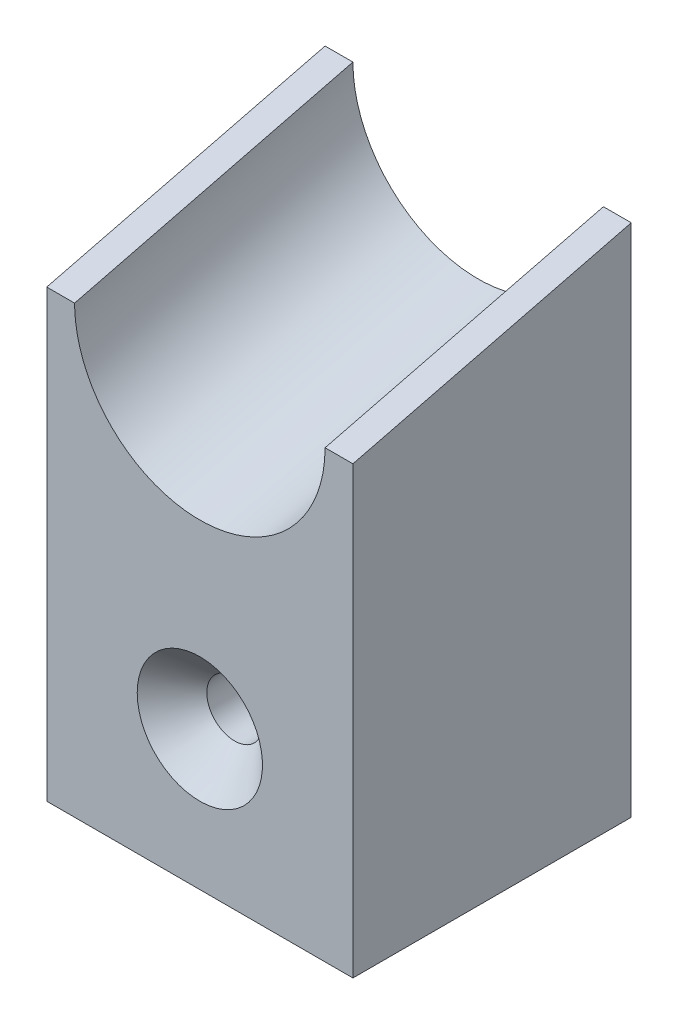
from build123d import *

# Parameters (mm, degrees)
SKETCH1_W                    = 22
SKETCH1_H                    = 20
EXTRUDE1_DEPTH               = 37
EXTRUDE2_DEPTH               = 40.874804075
EXTRUDE2_DEPTH_BACK          = 40.874804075
SKETCH4_R                    = 9
EXTRUDE3_DEPTH               = 37
F_8_0_8_DIAMETER_HOLE1_D     = 8
F_8_0_8_DIAMETER_HOLE1_DEPTH = 19
F_8_0_8_DIAMETER_HOLE1_TIP   = 2.403442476
EXTRUDE4_REACH               = 45.474
EXTRUDE4_END_RADIUS          = 4
SKETCH8_R                    = 2
CHAMFER1_SIZE                = 2.5


with BuildPart() as part:
    # Sketch1 → Extrude1 (new body)
    with BuildSketch(Plane(origin=(0, 0, 0), x_dir=(1, 0, 0), z_dir=(0, 1, 0))):
        Rectangle(SKETCH1_W, SKETCH1_H)
    extrude(amount=EXTRUDE1_DEPTH)

    # Sketch3 → Extrude2 (cut, two sides: drawn at the far end of the back side and taken through both)
    with BuildSketch(Plane(origin=(0, 0, 0), x_dir=(0, 0, -1), z_dir=(1, 0, 0)).offset(-EXTRUDE2_DEPTH_BACK)):
        Polygon((101.308806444, 59.827201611), (10, 37), (-10, 32), (-101.308806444, 9.172798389), (-146.963209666, 191.790411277), (55.654403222, 242.444814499), align=None)
    extrude(amount=EXTRUDE2_DEPTH + EXTRUDE2_DEPTH_BACK, mode=Mode.SUBTRACT)

    # Sketch4 → Extrude3 (cut, along a direction that is not the sketch's normal)
    with BuildSketch(Plane(origin=(0, 0, -10), x_dir=(-1, 0, 0), z_dir=(0, 0, -1))):
        with Locations((0, 37)):
            Circle(SKETCH4_R)
    extrude(amount=-EXTRUDE3_DEPTH, dir=(0, 0.24253562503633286, -0.970142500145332), mode=Mode.SUBTRACT)

    # 8.0 _8_ Diameter Hole1
    with Locations(Plane.XZ):
        with Locations((0, 0)):
            Hole(F_8_0_8_DIAMETER_HOLE1_D / 2, depth=F_8_0_8_DIAMETER_HOLE1_DEPTH)
            with Locations((0, 0, -(F_8_0_8_DIAMETER_HOLE1_DEPTH + F_8_0_8_DIAMETER_HOLE1_TIP / 2))):  # 118° drill point
                Cone(0, F_8_0_8_DIAMETER_HOLE1_D / 2, F_8_0_8_DIAMETER_HOLE1_TIP, mode=Mode.SUBTRACT)

    # Extrude4: up to this cylinder (the profile starts outside it)
    extrude4_end = Plane(origin=(0, 10, 0), z_dir=(0, -1, 0)) * Cylinder(EXTRUDE4_END_RADIUS, 99.948, mode=Mode.PRIVATE)
    # Sketch8 → Extrude4 (cut, up to the surface)
    with BuildSketch(Plane.XY.offset(10), mode=Mode.PRIVATE) as extrude4_sk1:
        with Locations((0, 10)):
            Circle(SKETCH8_R)
    extrude4_tool1 = extrude(extrude4_sk1.sketch, amount=-EXTRUDE4_REACH, mode=Mode.PRIVATE) - extrude4_end
    add(extrude4_tool1.solids().sort_by_distance((0, 10, 10))[0], mode=Mode.SUBTRACT)

    # Chamfer1
    chamfer1_edges = [part.edges().sort_by_distance(p)[0] for p in [
        (-2, 10, 10),
    ]]
    chamfer(chamfer1_edges, length=CHAMFER1_SIZE)


solid = part.part
